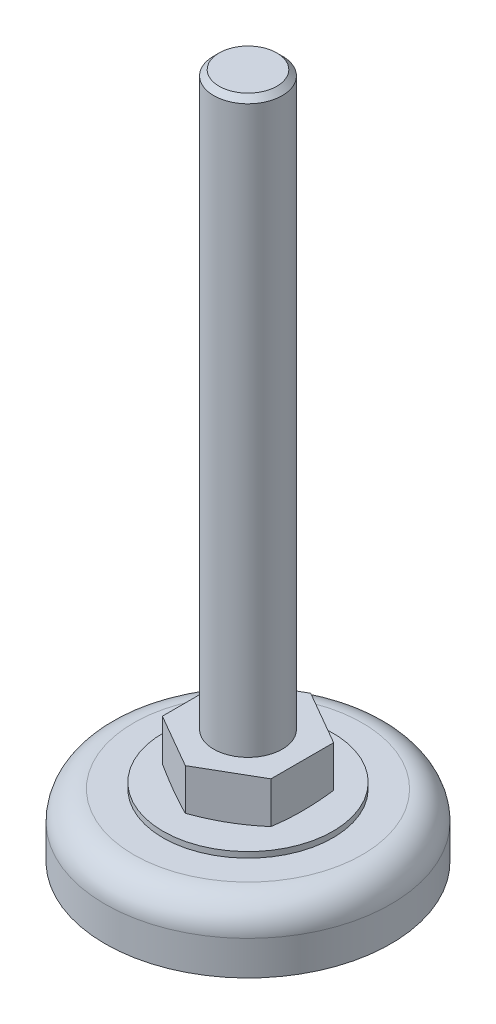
from build123d import *

# Parameters (mm, degrees)
SKETCH_2_W          = 118.282051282
SKETCH_2_H          = 95.307692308
CUT_EXTRUDE_1_DEPTH = 9


with BuildPart() as part:
    # Sketch 1 → Revolve 1 (revolve)
    with BuildSketch(Plane.XY, mode=Mode.PRIVATE) as revolve_1_sk:
        with BuildLine():
            Line((0, 124), (5.053, 124))
            Line((5.053, 124), (6, 123.053))
            Line((6, 123.053), (6, 24))
            Line((6, 24), (11.875, 24))
            Line((11.875, 24), (11.875, 17))
            Line((11.875, 17), (8, 16))
            Line((8, 16), (14.875, 16))
            Line((14.875, 16), (14.875, 15))
            Line((14.875, 15), (20, 15))
            ThreePointArc((20, 15), (23.535533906, 13.535533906), (25, 10))
            Line((25, 10), (25, 4))
            Line((25, 4), (18.5, 4))
            Line((18.5, 4), (18.5, 0))
            Line((18.5, 0), (7.5, 0))
            Line((7.5, 0), (7.5, 4))
            Line((7.5, 4), (0, 4))
            Line((0, 4), (0, 124))
        make_face()
    revolve(revolve_1_sk.sketch.rotate(Axis((0, 0, 0), (0, 1, 0)), 270), axis=Axis((0, 0, 0), (0, 1, 0)))

    # Sketch 2 → Cut-Extrude 1 (cut)
    with BuildSketch(Plane(origin=(0, 16, 0), x_dir=(-1, 0, 0), z_dir=(0, 1, 0))):
        with Locations((-0.717948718, -2.333333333)):
            Rectangle(SKETCH_2_W, SKETCH_2_H)
        Polygon((9.5, -5.484827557), (9.5, 5.484827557), (0, 10.969655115), (-9.5, 5.484827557), (-9.5, -5.484827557), (0, -10.969655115), align=None, mode=Mode.SUBTRACT)
    extrude(amount=CUT_EXTRUDE_1_DEPTH, mode=Mode.SUBTRACT)


solid = part.part
